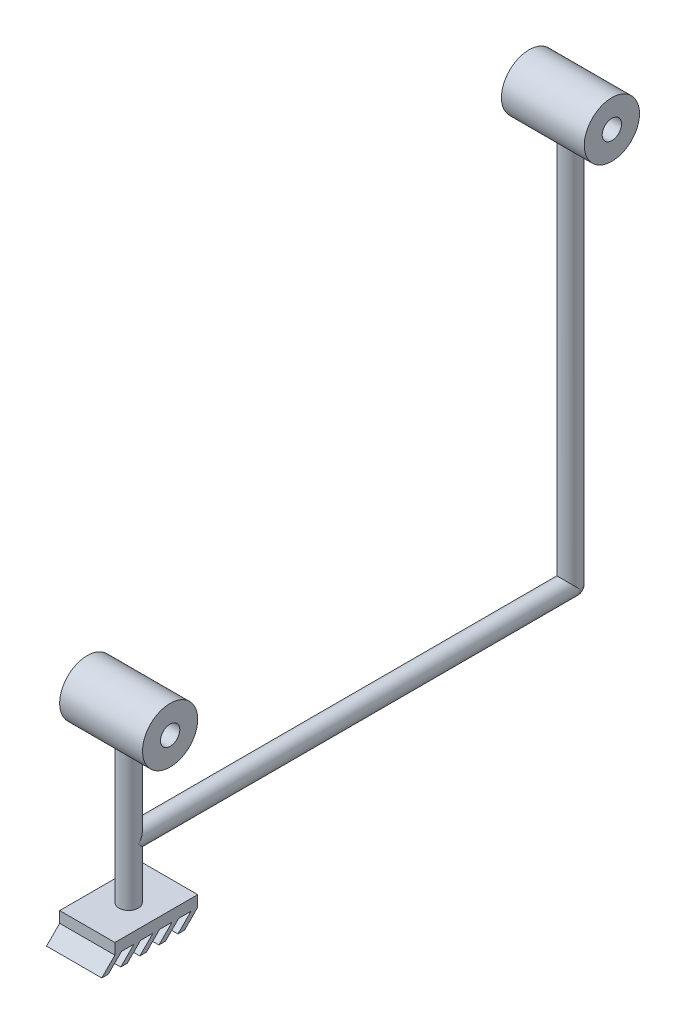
from build123d import *

# Parameters (mm, degrees)
ESQUISSE1_R             = 3.5
EXTRUSION1_DEPTH        = 160
ESQUISSE2_R             = 3.5
EXTRUSION2_DEPTH        = 40
EXTRUSION3_DEPTH        = 15
EXTRUSION3_DEPTH_BACK   = 15
ESQUISSE3_R             = 10
ESQUISSE4_R             = 3.5
EXTRUSION4_DEPTH        = 150
EXTRUSION5_DEPTH        = 15
EXTRUSION5_DEPTH_BACK   = 15
ESQUISSE5_R             = 10
EXTRUSION6_START        = 20
ESQUISSE6_R             = 3.5
EXTRUSION6_DEPTH        = 20
ESQUISSE7_W             = 20
ESQUISSE7_H             = 30
EXTRUSION7_DEPTH        = 4
ESQUISSE8_R             = 3.5
ENL_V_MAT_EXTRU_1_DEPTH = 34
EXTRUSION8_DEPTH        = 20


with BuildPart() as part:
    # Esquisse1 → Extrusion1 (new body)
    with BuildSketch(Plane.XY):
        Circle(ESQUISSE1_R)
    extrude(amount=-EXTRUSION1_DEPTH)

    # Esquisse2 → Extrusion2 (add)
    with BuildSketch(Plane(origin=(0, 0, 0), x_dir=(1, 0, 0), z_dir=(0, 1, 0))):
        with Locations(Location((0, 0, 0), (0, 0, 180))):
            Circle(ESQUISSE2_R)
    extrude(amount=EXTRUSION2_DEPTH)

    # Esquisse3 → Extrusion3 (add, two sides: drawn at the far end of the back side and taken through both)
    with BuildSketch(Plane(origin=(0, 0, 0), x_dir=(0, 0, -1), z_dir=(1, 0, 0)).offset(-EXTRUSION3_DEPTH_BACK)):
        with Locations((0, 40)):
            Circle(ESQUISSE3_R)
    extrude(amount=EXTRUSION3_DEPTH + EXTRUSION3_DEPTH_BACK)

    # Esquisse4 → Extrusion4 (add)
    with BuildSketch(Plane(origin=(0, 0, 0), x_dir=(1, 0, 0), z_dir=(0, 1, 0))):
        with Locations((0, 160)):
            Circle(ESQUISSE4_R)
    extrude(amount=EXTRUSION4_DEPTH)

    # Esquisse5 → Extrusion5 (add, two sides: drawn at the far end of the back side and taken through both)
    with BuildSketch(Plane(origin=(0, 0, 0), x_dir=(0, 0, -1), z_dir=(1, 0, 0)).offset(-EXTRUSION5_DEPTH_BACK)):
        with Locations((160, 150)):
            Circle(ESQUISSE5_R)
    extrude(amount=EXTRUSION5_DEPTH + EXTRUSION5_DEPTH_BACK)

    # Esquisse6 → Extrusion6 (add)
    with BuildSketch(Plane.XZ.offset(EXTRUSION6_START)):
        with Locations(Location((0, 0, 0), (0, 0, 270))):
            Circle(ESQUISSE6_R)
    extrude(amount=-EXTRUSION6_DEPTH)

    # Esquisse7 → Extrusion7 (add)
    with BuildSketch(Plane.XZ.offset(20)):
        Rectangle(ESQUISSE7_W, ESQUISSE7_H)
    extrude(amount=EXTRUSION7_DEPTH)

    # Esquisse8 → Enl_v. mat.-Extru.1 (cut)
    with BuildSketch(Plane(origin=(15, 0, 0), x_dir=(0, 0, -1), z_dir=(1, 0, 0))):
        with Locations((0, 40)):
            Circle(ESQUISSE8_R)
        with Locations((160, 150)):
            Circle(ESQUISSE8_R)
    extrude(amount=-ENL_V_MAT_EXTRU_1_DEPTH, mode=Mode.SUBTRACT)

    # Esquisse9 → R_volution1 (revolve)
    with BuildSketch(Plane.XZ):
        with BuildLine():
            Line((3.5, -160), (-3.5, -160))
            ThreePointArc((-3.5, -160), (0, -163.5), (3.5, -160))
        make_face()
    revolve(axis=Axis((12.841820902, 0, -160), (-1, 0, 0)))

    # Esquisse10 → Extrusion8 (add)
    with BuildSketch(Plane(origin=(10, 0, 0), x_dir=(0, 0, -1), z_dir=(1, 0, 0))):
        Polygon((-15, -24), (-19.7694287, -28.7694287), (-17.38471435, -28.7694287), (-12.61528565, -24), align=None)
        Polygon((-5.71528565, -24), (-8.1, -24), (-12.8694287, -28.7694287), (-10.48471435, -28.7694287), align=None)
        Polygon((1.18471435, -24), (-1.2, -24), (-5.9694287, -28.7694287), (-3.58471435, -28.7694287), align=None)
        Polygon((8.08471435, -24), (5.7, -24), (0.9305713, -28.7694287), (3.31528565, -28.7694287), align=None)
        Polygon((14.98471435, -24), (12.6, -24), (7.8305713, -28.7694287), (10.21528565, -28.7694287), align=None)
    extrude(amount=-EXTRUSION8_DEPTH)


solid = part.part
